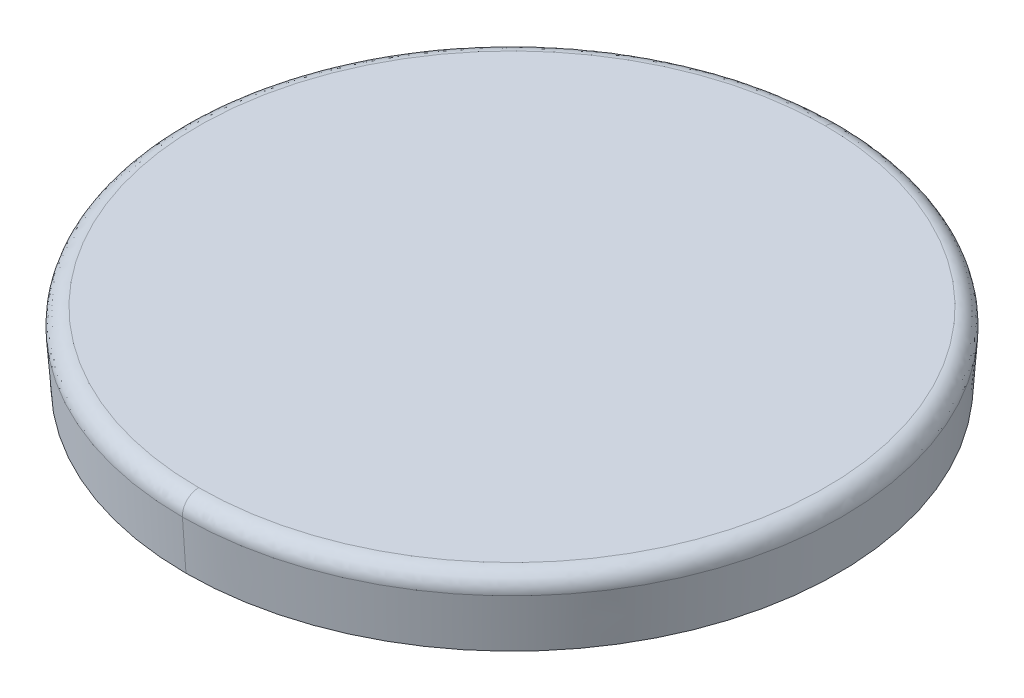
ISO-10303-21;
HEADER;
FILE_DESCRIPTION(('STEP AP214'),'2;1');
FILE_NAME('part.step','',(''),(''),'','','');
FILE_SCHEMA(('AUTOMOTIVE_DESIGN { 1 0 10303 214 1 1 1 1 }'));
ENDSEC;
DATA;
#1=APPLICATION_CONTEXT('core data for automotive mechanical design processes');
#2=APPLICATION_PROTOCOL_DEFINITION('international standard','automotive_design',2000,#1);
#3=PRODUCT_CONTEXT('',#1,'mechanical');
#4=PRODUCT('Part','Part','',(#3));
#5=PRODUCT_RELATED_PRODUCT_CATEGORY('part','',(#4));
#6=PRODUCT_DEFINITION_FORMATION('','',#4);
#7=PRODUCT_DEFINITION_CONTEXT('part definition',#1,'design');
#8=PRODUCT_DEFINITION('design','',#6,#7);
#9=PRODUCT_DEFINITION_SHAPE('','',#8);
#10=(LENGTH_UNIT() NAMED_UNIT(*) SI_UNIT(.MILLI.,.METRE.));
#11=(NAMED_UNIT(*) PLANE_ANGLE_UNIT() SI_UNIT($,.RADIAN.));
#12=(NAMED_UNIT(*) SI_UNIT($,.STERADIAN.) SOLID_ANGLE_UNIT());
#13=UNCERTAINTY_MEASURE_WITH_UNIT(LENGTH_MEASURE(1.E-05),#10,'distance_accuracy_value','');
#14=(GEOMETRIC_REPRESENTATION_CONTEXT(3) GLOBAL_UNCERTAINTY_ASSIGNED_CONTEXT((#13)) GLOBAL_UNIT_ASSIGNED_CONTEXT((#10,
#11,#12)) REPRESENTATION_CONTEXT('',''));
#15=CARTESIAN_POINT('',(0.,0.,0.));
#16=DIRECTION('',(0.,0.,1.));
#17=DIRECTION('',(1.,0.,0.));
#18=AXIS2_PLACEMENT_3D('',#15,#16,#17);
#19=CARTESIAN_POINT('',(-32.,13.2498463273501,7.06539894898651));
#20=CARTESIAN_POINT('',(-20.469202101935,13.2498463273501,7.0653989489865));
#21=CARTESIAN_POINT('',(-20.469202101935,13.2498463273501,-4.46539894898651));
#22=CARTESIAN_POINT('',(-32.,13.2498463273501,-4.46539894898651));
#23=CARTESIAN_POINT('',(-32.,13.2560836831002,7.26019516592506));
#24=CARTESIAN_POINT('',(-20.0796096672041,13.2560836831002,7.26019516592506));
#25=CARTESIAN_POINT('',(-20.0796096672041,13.2560836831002,-4.66019516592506));
#26=CARTESIAN_POINT('',(-32.,13.2560836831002,-4.66019516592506));
#27=CARTESIAN_POINT('',(-32.,13.1135846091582,7.39317039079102));
#28=CARTESIAN_POINT('',(-19.8136592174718,13.1135846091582,7.39317039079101));
#29=CARTESIAN_POINT('',(-19.8136592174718,13.1135846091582,-4.793170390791));
#30=CARTESIAN_POINT('',(-32.,13.1135846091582,-4.79317039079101));
#31=CARTESIAN_POINT('',(-32.,12.9196672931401,7.37346260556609));
#32=CARTESIAN_POINT('',(-19.8530747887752,12.9196672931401,7.3734626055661));
#33=CARTESIAN_POINT('',(-19.8530747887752,12.9196672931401,-4.7734626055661));
#34=CARTESIAN_POINT('',(-32.,12.9196672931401,-4.77346260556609));
#35=(BOUNDED_SURFACE() B_SPLINE_SURFACE(3,3,((#19,#20,#21,#22),(#23,#24,#25,#26),(#27,#28,#29,
#30),(#31,#32,#33,#34)),.UNSPECIFIED.,.F.,.F.,.F.) B_SPLINE_SURFACE_WITH_KNOTS((4,4),(4,4),
(0.0420276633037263,0.957651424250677),(0.,1.),
.UNSPECIFIED.) GEOMETRIC_REPRESENTATION_ITEM() RATIONAL_B_SPLINE_SURFACE(((0.96824045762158,
0.322746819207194,0.322746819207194,0.96824045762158),(0.747718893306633,0.249239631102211,
0.249239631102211,0.747718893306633),(0.747641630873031,0.249213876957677,0.249213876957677,
0.747641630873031),(0.968008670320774,0.322669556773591,0.322669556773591,0.968008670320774))) REPRESENTATION_ITEM('') SURFACE());
#36=CARTESIAN_POINT('',(-32.,12.9290767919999,1.3));
#37=DIRECTION('',(0.,1.,0.));
#38=DIRECTION('',(0.,0.,1.));
#39=AXIS2_PLACEMENT_3D('',#36,#37,#38);
#40=CIRCLE('',#39,6.074269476);
#41=CARTESIAN_POINT('',(-32.,12.9290767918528,7.37426947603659));
#42=VERTEX_POINT('',#41);
#43=CARTESIAN_POINT('',(-32.0000000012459,12.9290767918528,-4.77426947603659));
#44=VERTEX_POINT('',#43);
#45=EDGE_CURVE('E84',#42,#44,#40,.T.);
#46=CARTESIAN_POINT('',(-32.0000000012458,12.9290767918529,-4.77426947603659));
#47=CARTESIAN_POINT('',(-32.,13.1142460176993,-4.78721544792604));
#48=CARTESIAN_POINT('',(-32.,13.2499999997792,-4.6606212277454));
#49=CARTESIAN_POINT('',(-32.,13.2500000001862,-4.47499999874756));
#50=(BOUNDED_CURVE() B_SPLINE_CURVE(3,(#46,#47,#48,#49),.UNSPECIFIED.,.F.,
.F.) B_SPLINE_CURVE_WITH_KNOTS((4,4),(0.061361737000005,0.938638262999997),
.UNSPECIFIED.) CURVE() GEOMETRIC_REPRESENTATION_ITEM() RATIONAL_B_SPLINE_CURVE((0.954565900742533,
0.752199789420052,0.752199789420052,0.954565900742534)) REPRESENTATION_ITEM(''));
#51=CARTESIAN_POINT('',(-32.,13.2500000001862,-4.47499999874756));
#52=VERTEX_POINT('',#51);
#53=EDGE_CURVE('E92',#44,#52,#50,.T.);
#54=CARTESIAN_POINT('',(-32.,13.2500000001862,7.07499999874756));
#55=CARTESIAN_POINT('',(-31.8717520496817,13.25,7.07499999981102));
#56=CARTESIAN_POINT('',(-31.6797419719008,13.25,7.06861172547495));
#57=CARTESIAN_POINT('',(-31.4563634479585,13.25,7.0499792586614));
#58=CARTESIAN_POINT('',(-31.3448324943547,13.25,7.03786815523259));
#59=CARTESIAN_POINT('',(-31.2970674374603,13.25,7.03207878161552));
#60=CARTESIAN_POINT('',(-31.265231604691,13.25,7.02808611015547));
#61=CARTESIAN_POINT('',(-31.2513858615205,13.25,7.02630006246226));
#62=CARTESIAN_POINT('',(-31.0895768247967,13.25,7.00464374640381));
#63=CARTESIAN_POINT('',(-30.8754032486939,13.25,6.96771947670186));
#64=CARTESIAN_POINT('',(-30.6282847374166,13.25,6.91055509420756));
#65=CARTESIAN_POINT('',(-30.5054131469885,13.25,6.87845138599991));
#66=CARTESIAN_POINT('',(-30.4441492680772,13.25,6.86151915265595));
#67=CARTESIAN_POINT('',(-30.41793015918,13.25,6.85407382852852));
#68=CARTESIAN_POINT('',(-30.4004589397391,13.25,6.84906835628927));
#69=CARTESIAN_POINT('',(-30.392819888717,13.25,6.84686318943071));
#70=CARTESIAN_POINT('',(-30.2258817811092,13.25,6.79818896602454));
#71=CARTESIAN_POINT('',(-29.9938408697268,13.25,6.71970709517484));
#72=CARTESIAN_POINT('',(-29.7294902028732,13.25,6.61105560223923));
#73=CARTESIAN_POINT('',(-29.598905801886,13.25,6.552457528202));
#74=CARTESIAN_POINT('',(-29.5340113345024,13.25,6.52209040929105));
#75=CARTESIAN_POINT('',(-29.506284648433,13.25,6.50884705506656));
#76=CARTESIAN_POINT('',(-29.4878191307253,13.25,6.49996729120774));
#77=CARTESIAN_POINT('',(-29.4796725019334,13.25,6.4960267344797));
#78=CARTESIAN_POINT('',(-29.3047343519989,13.25,6.41076325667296));
#79=CARTESIAN_POINT('',(-29.0644508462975,13.25,6.27920086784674));
#80=CARTESIAN_POINT('',(-28.7958240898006,13.25,6.10612817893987));
#81=CARTESIAN_POINT('',(-28.6644367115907,13.25,6.01469602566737));
#82=CARTESIAN_POINT('',(-28.5994745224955,13.25,5.96775599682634));
#83=CARTESIAN_POINT('',(-28.5717903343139,13.25,5.94737656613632));
#84=CARTESIAN_POINT('',(-28.5533690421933,13.25,5.93373199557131));
#85=CARTESIAN_POINT('',(-28.5451235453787,13.25,5.92759123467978));
#86=CARTESIAN_POINT('',(-28.3730232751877,13.25,5.79854024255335));
#87=CARTESIAN_POINT('',(-28.1407873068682,13.25,5.6046029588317));
#88=CARTESIAN_POINT('',(-27.8886213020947,13.25,5.35778441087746));
#89=CARTESIAN_POINT('',(-27.7672322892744,13.25,5.22923554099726));
#90=CARTESIAN_POINT('',(-27.7162142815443,13.25,5.17304182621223));
#91=CARTESIAN_POINT('',(-27.6824257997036,13.25,5.13533460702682));
#92=CARTESIAN_POINT('',(-27.667042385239,13.25,5.1179614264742));
#93=CARTESIAN_POINT('',(-27.5044143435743,13.25,4.93165105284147));
#94=CARTESIAN_POINT('',(-27.3029255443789,13.25,4.6724924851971));
#95=CARTESIAN_POINT('',(-27.09471531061,13.25,4.35133753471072));
#96=CARTESIAN_POINT('',(-26.9973252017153,13.25,4.18605923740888));
#97=CARTESIAN_POINT('',(-26.9570255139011,13.25,4.1142183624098));
#98=CARTESIAN_POINT('',(-26.9304788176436,13.25,4.0661005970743));
#99=CARTESIAN_POINT('',(-26.9181291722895,13.25,4.0433616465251));
#100=CARTESIAN_POINT('',(-26.794672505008,13.25,3.81193035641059));
#101=CARTESIAN_POINT('',(-26.6496531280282,13.25,3.49562925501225));
#102=CARTESIAN_POINT('',(-26.5147455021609,13.25,3.11309071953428));
#103=CARTESIAN_POINT('',(-26.4642740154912,13.25,2.94624836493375));
#104=CARTESIAN_POINT('',(-26.4322588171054,13.25,2.83437629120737));
#105=CARTESIAN_POINT('',(-26.4174942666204,13.25,2.77979827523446));
#106=CARTESIAN_POINT('',(-26.2842766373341,13.25,2.25545995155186));
#107=CARTESIAN_POINT('',(-26.225045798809,13.25,1.78088619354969));
#108=CARTESIAN_POINT('',(-26.2249771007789,13.25,1.05955690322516));
#109=CARTESIAN_POINT('',(-26.2471714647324,13.25,0.701532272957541));
#110=CARTESIAN_POINT('',(-26.31196513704,13.25,0.288456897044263));
#111=CARTESIAN_POINT('',(-26.3480696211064,13.25,0.11241459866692));
#112=CARTESIAN_POINT('',(-26.3739916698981,13.25,-0.00472693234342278));
#113=CARTESIAN_POINT('',(-26.3883494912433,13.25,-0.0650414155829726));
#114=CARTESIAN_POINT('',(-26.4600635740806,13.25,-0.347526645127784));
#115=CARTESIAN_POINT('',(-26.5658069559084,13.25,-0.679031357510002));
#116=CARTESIAN_POINT('',(-26.7236255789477,13.25,-1.05270111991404));
#117=CARTESIAN_POINT('',(-26.8111477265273,13.25,-1.23626456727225));
#118=CARTESIAN_POINT('',(-26.8505028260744,13.25,-1.3142335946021));
#119=CARTESIAN_POINT('',(-26.8771496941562,13.25,-1.36605716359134));
#120=CARTESIAN_POINT('',(-26.8914829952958,13.25,-1.3934003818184));
#121=CARTESIAN_POINT('',(-27.0078419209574,13.25,-1.6116204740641));
#122=CARTESIAN_POINT('',(-27.1784846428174,13.25,-1.89205218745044));
#123=CARTESIAN_POINT('',(-27.4046884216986,13.25,-2.20079780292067));
#124=CARTESIAN_POINT('',(-27.5245704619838,13.25,-2.35056443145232));
#125=CARTESIAN_POINT('',(-27.5774013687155,13.25,-2.41376309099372));
#126=CARTESIAN_POINT('',(-27.6129448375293,13.25,-2.45567618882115));
#127=CARTESIAN_POINT('',(-27.6323340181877,13.25,-2.47819172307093));
#128=CARTESIAN_POINT('',(-27.7820812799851,13.25,-2.64980868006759));
#129=CARTESIAN_POINT('',(-27.9926662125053,13.25,-2.86706245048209));
#130=CARTESIAN_POINT('',(-28.2574619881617,13.25,-3.10027971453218));
#131=CARTESIAN_POINT('',(-28.3946382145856,13.25,-3.21182697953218));
#132=CARTESIAN_POINT('',(-28.4644209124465,13.25,-3.26633527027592));
#133=CARTESIAN_POINT('',(-28.4945837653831,13.25,-3.28942482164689));
#134=CARTESIAN_POINT('',(-28.5147492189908,13.25,-3.30475760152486));
#135=CARTESIAN_POINT('',(-28.5258424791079,13.25,-3.31313057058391));
#136=CARTESIAN_POINT('',(-28.6815203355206,13.25,-3.42991086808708));
#137=CARTESIAN_POINT('',(-28.9082083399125,13.25,-3.58372042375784));
#138=CARTESIAN_POINT('',(-29.1847658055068,13.25,-3.74381559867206));
#139=CARTESIAN_POINT('',(-29.3260665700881,13.25,-3.81902585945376));
#140=CARTESIAN_POINT('',(-29.3974724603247,13.25,-3.85542165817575));
#141=CARTESIAN_POINT('',(-29.4282368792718,13.25,-3.87076071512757));
#142=CARTESIAN_POINT('',(-29.448782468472,13.25,-3.88092916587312));
#143=CARTESIAN_POINT('',(-29.4601880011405,13.25,-3.88652815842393));
#144=CARTESIAN_POINT('',(-29.6164863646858,13.25,-3.96274047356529));
#145=CARTESIAN_POINT('',(-29.8410168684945,13.25,-4.06066099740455));
#146=CARTESIAN_POINT('',(-30.1097486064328,13.25,-4.15797327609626));
#147=CARTESIAN_POINT('',(-30.2458093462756,13.25,-4.20239733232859));
#148=CARTESIAN_POINT('',(-30.3142634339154,13.25,-4.22355133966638));
#149=CARTESIAN_POINT('',(-30.3436916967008,13.25,-4.23239062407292));
#150=CARTESIAN_POINT('',(-30.3633307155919,13.25,-4.23823309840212));
#151=CARTESIAN_POINT('',(-30.3742934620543,13.25,-4.24145975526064));
#152=CARTESIAN_POINT('',(-30.5223046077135,13.25,-4.28464391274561));
#153=CARTESIAN_POINT('',(-30.7330839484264,13.25,-4.33761357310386));
#154=CARTESIAN_POINT('',(-30.9821824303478,13.25,-4.38541814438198));
#155=CARTESIAN_POINT('',(-31.1075289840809,13.25,-4.40582208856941));
#156=CARTESIAN_POINT('',(-31.1614197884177,13.25,-4.41381699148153));
#157=CARTESIAN_POINT('',(-31.1973849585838,13.25,-4.41898033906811));
#158=CARTESIAN_POINT('',(-31.2175180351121,13.25,-4.42176438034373));
#159=CARTESIAN_POINT('',(-31.487631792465,13.25,-4.45796460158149));
#160=CARTESIAN_POINT('',(-31.743162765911,13.25,-4.47499999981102));
#161=CARTESIAN_POINT('',(-32.,13.2500000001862,-4.47499999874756));
#162=(BOUNDED_CURVE() B_SPLINE_CURVE(3,(#54,#55,#56,#57,#58,#59,#60,#61,#62,#63,#64,#65,#66,#67,
#68,#69,#70,#71,#72,#73,#74,#75,#76,#77,#78,#79,#80,#81,#82,#83,#84,#85,#86,#87,#88,#89,#90,#91,
#92,#93,#94,#95,#96,#97,#98,#99,#100,#101,#102,#103,#104,#105,#106,#107,#108,#109,#110,#111,
#112,#113,#114,#115,#116,#117,#118,#119,#120,#121,#122,#123,#124,#125,#126,#127,#128,#129,#130,
#131,#132,#133,#134,#135,#136,#137,#138,#139,#140,#141,#142,#143,#144,#145,#146,#147,#148,#149,
#150,#151,#152,#153,#154,#155,#156,#157,#158,#159,#160,#161),.UNSPECIFIED.,.F.,
.F.) B_SPLINE_CURVE_WITH_KNOTS((4,1,1,1,2,2,1,1,1,1,2,2,1,1,1,1,2,2,1,1,1,1,2,2,1,1,1,2,2,1,1,1,
2,2,1,1,2,2,2,1,1,2,2,1,1,1,2,2,1,1,1,2,2,1,1,1,1,2,2,1,1,1,1,2,2,1,1,1,1,2,2,1,1,1,2,2,4),(0.,
0.0312500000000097,0.0468750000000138,0.0546875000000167,0.0585937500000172,0.0625000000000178,
0.0937500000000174,0.109375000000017,0.117187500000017,0.121093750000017,0.123046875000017,
0.125000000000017,0.156250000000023,0.171875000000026,0.179687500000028,0.183593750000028,
0.185546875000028,0.187500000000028,0.218750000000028,0.234375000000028,0.242187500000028,
0.246093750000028,0.248046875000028,0.250000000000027,0.281250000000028,0.296875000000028,
0.304687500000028,0.308593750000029,0.312500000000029,0.343750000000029,0.359375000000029,
0.367187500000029,0.371093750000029,0.375000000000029,0.406250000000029,0.421875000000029,
0.429687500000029,0.437500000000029,0.5,0.53125000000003,0.54687500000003,0.55468750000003,
0.56250000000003,0.59375000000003,0.60937500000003,0.61718750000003,0.62109375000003,
0.62500000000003,0.65625000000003,0.67187500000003,0.67968750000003,0.68359375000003,
0.68750000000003,0.718750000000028,0.734375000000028,0.742187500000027,0.746093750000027,
0.748046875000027,0.750000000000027,0.781250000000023,0.796875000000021,0.804687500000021,
0.808593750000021,0.81054687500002,0.81250000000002,0.843750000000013,0.85937500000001,
0.8671875,0.871093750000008,0.873046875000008,0.875,0.90625,0.921875,0.9296875,0.93359375,
0.9375,1.),.UNSPECIFIED.) CURVE() GEOMETRIC_REPRESENTATION_ITEM() RATIONAL_B_SPLINE_CURVE((1.,
1.,1.,1.,1.,1.,1.,1.,1.,1.,1.,1.,1.,1.,1.,1.,1.,1.,1.,1.,1.,1.,1.,1.,1.,1.,1.,1.,1.,1.,1.,1.,1.,
1.,1.,1.,1.,1.,1.,1.,1.,1.,1.,1.,1.,1.,1.,1.,1.,1.,1.,1.,1.,1.,1.,1.,1.,1.,1.,1.,1.,1.,1.,1.,1.,
1.,1.,1.,1.,1.,1.,1.,1.,1.,1.,1.,1.,1.,1.,1.,1.,1.,1.,1.,1.,1.,1.,1.,1.,1.,1.,1.,1.,1.,1.,1.,1.,
1.,1.,1.,1.,1.,1.,1.,1.,1.,1.,1.)) REPRESENTATION_ITEM(''));
#163=CARTESIAN_POINT('',(-32.,13.2500000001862,7.07499999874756));
#164=VERTEX_POINT('',#163);
#165=EDGE_CURVE('E11',#164,#52,#162,.T.);
#166=CARTESIAN_POINT('',(-32.,13.2500000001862,7.07499999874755));
#167=CARTESIAN_POINT('',(-32.,13.2499999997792,7.2606212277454));
#168=CARTESIAN_POINT('',(-32.,13.1142460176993,7.38721544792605));
#169=CARTESIAN_POINT('',(-32.,12.9290767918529,7.3742694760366));
#170=(BOUNDED_CURVE() B_SPLINE_CURVE(3,(#166,#167,#168,#169),.UNSPECIFIED.,.F.,
.F.) B_SPLINE_CURVE_WITH_KNOTS((4,4),(0.0613617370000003,0.938638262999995),
.UNSPECIFIED.) CURVE() GEOMETRIC_REPRESENTATION_ITEM() RATIONAL_B_SPLINE_CURVE((0.954565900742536,
0.752199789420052,0.752199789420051,0.954565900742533)) REPRESENTATION_ITEM(''));
#171=EDGE_CURVE('E21',#164,#42,#170,.T.);
#172=ORIENTED_EDGE('',*,*,#45,.T.);
#173=ORIENTED_EDGE('',*,*,#53,.T.);
#174=ORIENTED_EDGE('',*,*,#165,.F.);
#175=ORIENTED_EDGE('',*,*,#171,.T.);
#176=EDGE_LOOP('',(#172,#173,#174,#175));
#177=FACE_BOUND('',#176,.T.);
#178=ADVANCED_FACE('F16',(#177),#35,.T.);
#179=CARTESIAN_POINT('',(-37.8443,13.25,-4.5443));
#180=DIRECTION('',(0.,1.,0.));
#181=DIRECTION('',(1.,0.,0.));
#182=AXIS2_PLACEMENT_3D('',#179,#180,#181);
#183=PLANE('',#182);
#184=CARTESIAN_POINT('',(-32.,13.2500000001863,7.07499999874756));
#185=CARTESIAN_POINT('',(-43.5499999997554,13.2500000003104,7.07499999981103));
#186=CARTESIAN_POINT('',(-43.5499999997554,13.2500000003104,-4.47499999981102));
#187=CARTESIAN_POINT('',(-32.,13.2500000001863,-4.47499999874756));
#188=(BOUNDED_CURVE() B_SPLINE_CURVE(3,(#184,#185,#186,#187),.UNSPECIFIED.,.F.,
.F.) B_SPLINE_CURVE_WITH_KNOTS((4,4),(0.,1.),
.UNSPECIFIED.) CURVE() GEOMETRIC_REPRESENTATION_ITEM() RATIONAL_B_SPLINE_CURVE((0.954565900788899,
0.3181886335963,0.3181886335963,0.954565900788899)) REPRESENTATION_ITEM(''));
#189=EDGE_CURVE('E29',#164,#52,#188,.T.);
#190=ORIENTED_EDGE('',*,*,#189,.F.);
#191=ORIENTED_EDGE('',*,*,#165,.T.);
#192=EDGE_LOOP('',(#190,#191));
#193=FACE_BOUND('',#192,.T.);
#194=ADVANCED_FACE('F122',(#193),#183,.T.);
#195=CARTESIAN_POINT('',(-38.081425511,12.,7.381425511));
#196=DIRECTION('',(0.,-1.,0.));
#197=DIRECTION('',(0.,0.,-1.));
#198=AXIS2_PLACEMENT_3D('',#195,#196,#197);
#199=PLANE('',#198);
#200=CARTESIAN_POINT('',(-32.,12.,1.3));
#201=DIRECTION('',(0.,-1.,0.));
#202=DIRECTION('',(0.,0.,1.));
#203=AXIS2_PLACEMENT_3D('',#200,#201,#202);
#204=CIRCLE('',#203,6.00931374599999);
#205=CARTESIAN_POINT('',(-32.,12.,7.30931374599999));
#206=VERTEX_POINT('',#205);
#207=CARTESIAN_POINT('',(-32.,12.,-4.70931374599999));
#208=VERTEX_POINT('',#207);
#209=EDGE_CURVE('E63',#206,#208,#204,.T.);
#210=ORIENTED_EDGE('',*,*,#209,.T.);
#211=CARTESIAN_POINT('',(-32.,12.,1.3));
#212=DIRECTION('',(0.,-1.,0.));
#213=DIRECTION('',(0.,0.,1.));
#214=AXIS2_PLACEMENT_3D('',#211,#212,#213);
#215=CIRCLE('',#214,6.00931374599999);
#216=EDGE_CURVE('E67',#208,#206,#215,.T.);
#217=ORIENTED_EDGE('',*,*,#216,.T.);
#218=EDGE_LOOP('',(#210,#217));
#219=FACE_BOUND('',#218,.T.);
#220=ADVANCED_FACE('F65',(#219),#199,.T.);
#221=CARTESIAN_POINT('',(-32.,13.2499988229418,-4.47415951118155));
#222=CARTESIAN_POINT('',(-43.5483190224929,13.2499988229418,-4.47415951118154));
#223=CARTESIAN_POINT('',(-43.5483190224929,13.2499988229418,7.07415951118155));
#224=CARTESIAN_POINT('',(-32.,13.2499988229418,7.07415951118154));
#225=CARTESIAN_POINT('',(-32.,13.2505342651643,-4.66527714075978));
#226=CARTESIAN_POINT('',(-43.9305542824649,13.2505342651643,-4.66527714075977));
#227=CARTESIAN_POINT('',(-43.9305542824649,13.2505342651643,7.26527714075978));
#228=CARTESIAN_POINT('',(-32.,13.2505342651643,7.26527714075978));
#229=CARTESIAN_POINT('',(-32.,13.1087713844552,-4.79268122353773));
#230=CARTESIAN_POINT('',(-44.1853624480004,13.1087713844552,-4.79268122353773));
#231=CARTESIAN_POINT('',(-44.1853624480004,13.1087713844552,7.39268122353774));
#232=CARTESIAN_POINT('',(-32.,13.1087713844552,7.39268122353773));
#233=CARTESIAN_POINT('',(-32.,12.9196672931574,-4.77346260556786));
#234=CARTESIAN_POINT('',(-44.1469252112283,12.9196672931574,-4.77346260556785));
#235=CARTESIAN_POINT('',(-44.1469252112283,12.9196672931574,7.37346260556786));
#236=CARTESIAN_POINT('',(-32.,12.9196672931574,7.37346260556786));
#237=(BOUNDED_SURFACE() B_SPLINE_SURFACE(3,3,((#221,#222,#223,#224),(#225,#226,#227,#228),(#229,
#230,#231,#232),(#233,#234,#235,#236)),.UNSPECIFIED.,.F.,.F.,
.F.) B_SPLINE_SURFACE_WITH_KNOTS((4,4),(4,4),(0.0596803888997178,0.957651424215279),(0.,1.),
.UNSPECIFIED.) GEOMETRIC_REPRESENTATION_ITEM() RATIONAL_B_SPLINE_SURFACE(((0.955731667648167,
0.318577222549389,0.318577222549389,0.955731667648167),(0.747797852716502,0.249265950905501,
0.249265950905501,0.747797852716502),(0.751890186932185,0.250630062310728,0.250630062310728,
0.751890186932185),(0.968008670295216,0.322669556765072,0.322669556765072,0.968008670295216))) REPRESENTATION_ITEM('') SURFACE());
#238=CARTESIAN_POINT('',(-32.,12.9290767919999,1.3));
#239=DIRECTION('',(0.,1.,0.));
#240=DIRECTION('',(0.,0.,1.));
#241=AXIS2_PLACEMENT_3D('',#238,#239,#240);
#242=CIRCLE('',#241,6.074269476);
#243=EDGE_CURVE('E72',#44,#42,#242,.T.);
#244=ORIENTED_EDGE('',*,*,#53,.F.);
#245=ORIENTED_EDGE('',*,*,#243,.T.);
#246=ORIENTED_EDGE('',*,*,#171,.F.);
#247=ORIENTED_EDGE('',*,*,#189,.T.);
#248=EDGE_LOOP('',(#244,#245,#246,#247));
#249=FACE_BOUND('',#248,.T.);
#250=ADVANCED_FACE('F121',(#249),#237,.T.);
#251=CARTESIAN_POINT('',(-32.,12.,1.3));
#252=DIRECTION('',(0.,1.,0.));
#253=DIRECTION('',(0.,0.,1.));
#254=AXIS2_PLACEMENT_3D('',#251,#252,#253);
#255=CONICAL_SURFACE('',#254,6.009313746,0.0698006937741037);
#256=DIRECTION('',(0.,0.997564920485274,-0.0697440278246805));
#257=VECTOR('',#256,1.);
#258=CARTESIAN_POINT('',(-32.,12.,-4.709313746));
#259=LINE('',#258,#257);
#260=EDGE_CURVE('E77',#208,#44,#259,.T.);
#261=ORIENTED_EDGE('',*,*,#260,.F.);
#262=ORIENTED_EDGE('',*,*,#209,.F.);
#263=DIRECTION('',(0.,0.997564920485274,0.0697440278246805));
#264=VECTOR('',#263,1.);
#265=CARTESIAN_POINT('',(-32.,12.,7.309313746));
#266=LINE('',#265,#264);
#267=EDGE_CURVE('E73',#206,#42,#266,.T.);
#268=ORIENTED_EDGE('',*,*,#267,.T.);
#269=ORIENTED_EDGE('',*,*,#243,.F.);
#270=EDGE_LOOP('',(#261,#262,#268,#269));
#271=FACE_BOUND('',#270,.T.);
#272=ADVANCED_FACE('F78',(#271),#255,.T.);
#273=CARTESIAN_POINT('',(-32.,12.,1.3));
#274=DIRECTION('',(0.,1.,0.));
#275=DIRECTION('',(0.,0.,1.));
#276=AXIS2_PLACEMENT_3D('',#273,#274,#275);
#277=CONICAL_SURFACE('',#276,6.009313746,0.0698006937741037);
#278=ORIENTED_EDGE('',*,*,#216,.F.);
#279=ORIENTED_EDGE('',*,*,#260,.T.);
#280=ORIENTED_EDGE('',*,*,#45,.F.);
#281=ORIENTED_EDGE('',*,*,#267,.F.);
#282=EDGE_LOOP('',(#278,#279,#280,#281));
#283=FACE_BOUND('',#282,.T.);
#284=ADVANCED_FACE('F86',(#283),#277,.T.);
#285=CLOSED_SHELL('',(#178,#194,#220,#250,#272,#284));
#286=MANIFOLD_SOLID_BREP('B1',#285);
#287=ADVANCED_BREP_SHAPE_REPRESENTATION('',(#18,#286),#14);
#288=SHAPE_DEFINITION_REPRESENTATION(#9,#287);
ENDSEC;
END-ISO-10303-21;
